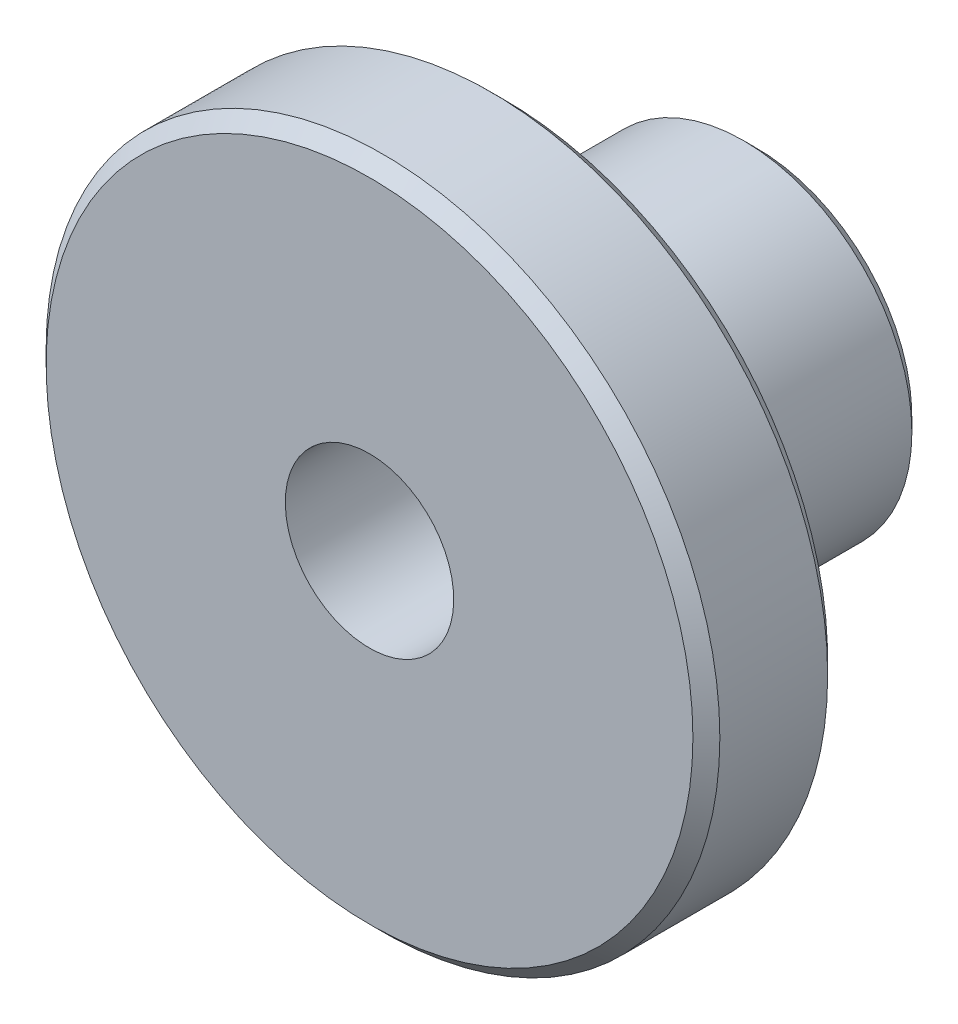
ISO-10303-21;
HEADER;
FILE_DESCRIPTION(('STEP AP214'),'2;1');
FILE_NAME('part.step','',(''),(''),'','','');
FILE_SCHEMA(('AUTOMOTIVE_DESIGN { 1 0 10303 214 1 1 1 1 }'));
ENDSEC;
DATA;
#1=APPLICATION_CONTEXT('core data for automotive mechanical design processes');
#2=APPLICATION_PROTOCOL_DEFINITION('international standard','automotive_design',2000,#1);
#3=PRODUCT_CONTEXT('',#1,'mechanical');
#4=PRODUCT('Part','Part','',(#3));
#5=PRODUCT_RELATED_PRODUCT_CATEGORY('part','',(#4));
#6=PRODUCT_DEFINITION_FORMATION('','',#4);
#7=PRODUCT_DEFINITION_CONTEXT('part definition',#1,'design');
#8=PRODUCT_DEFINITION('design','',#6,#7);
#9=PRODUCT_DEFINITION_SHAPE('','',#8);
#10=(LENGTH_UNIT() NAMED_UNIT(*) SI_UNIT(.MILLI.,.METRE.));
#11=(NAMED_UNIT(*) PLANE_ANGLE_UNIT() SI_UNIT($,.RADIAN.));
#12=(NAMED_UNIT(*) SI_UNIT($,.STERADIAN.) SOLID_ANGLE_UNIT());
#13=UNCERTAINTY_MEASURE_WITH_UNIT(LENGTH_MEASURE(1.E-05),#10,'distance_accuracy_value','');
#14=(GEOMETRIC_REPRESENTATION_CONTEXT(3) GLOBAL_UNCERTAINTY_ASSIGNED_CONTEXT((#13)) GLOBAL_UNIT_ASSIGNED_CONTEXT((#10,
#11,#12)) REPRESENTATION_CONTEXT('',''));
#15=CARTESIAN_POINT('',(0.,0.,0.));
#16=DIRECTION('',(0.,0.,1.));
#17=DIRECTION('',(1.,0.,0.));
#18=AXIS2_PLACEMENT_3D('',#15,#16,#17);
#19=CARTESIAN_POINT('',(0.,0.,0.));
#20=DIRECTION('',(0.,0.,-1.));
#21=DIRECTION('',(0.,1.,0.));
#22=AXIS2_PLACEMENT_3D('',#19,#20,#21);
#23=PLANE('',#22);
#24=CARTESIAN_POINT('',(0.,0.,0.));
#25=DIRECTION('',(0.,0.,-1.));
#26=DIRECTION('',(-1.,0.,0.));
#27=AXIS2_PLACEMENT_3D('',#24,#25,#26);
#28=CIRCLE('',#27,4.6);
#29=CARTESIAN_POINT('',(-4.6,0.,0.));
#30=VERTEX_POINT('',#29);
#31=EDGE_CURVE('E27',#30,#30,#28,.T.);
#32=ORIENTED_EDGE('',*,*,#31,.T.);
#33=EDGE_LOOP('',(#32));
#34=FACE_BOUND('',#33,.T.);
#35=CARTESIAN_POINT('',(0.,0.,0.));
#36=DIRECTION('',(0.,0.,-1.));
#37=DIRECTION('',(0.,1.,0.));
#38=AXIS2_PLACEMENT_3D('',#35,#36,#37);
#39=CIRCLE('',#38,2.5);
#40=CARTESIAN_POINT('',(0.,2.5,0.));
#41=VERTEX_POINT('',#40);
#42=EDGE_CURVE('E47',#41,#41,#39,.T.);
#43=ORIENTED_EDGE('',*,*,#42,.F.);
#44=EDGE_LOOP('',(#43));
#45=FACE_BOUND('',#44,.T.);
#46=ADVANCED_FACE('F12',(#34,#45),#23,.T.);
#47=CARTESIAN_POINT('',(0.,0.,-10.));
#48=DIRECTION('',(0.,0.,-1.));
#49=DIRECTION('',(0.,1.,0.));
#50=AXIS2_PLACEMENT_3D('',#47,#48,#49);
#51=CYLINDRICAL_SURFACE('',#50,5.);
#52=CARTESIAN_POINT('',(0.,0.,6.5));
#53=DIRECTION('',(0.,0.,-1.));
#54=DIRECTION('',(-1.,0.,0.));
#55=AXIS2_PLACEMENT_3D('',#52,#53,#54);
#56=CIRCLE('',#55,5.);
#57=CARTESIAN_POINT('',(-5.,0.,6.5));
#58=VERTEX_POINT('',#57);
#59=EDGE_CURVE('E19',#58,#58,#56,.T.);
#60=ORIENTED_EDGE('',*,*,#59,.T.);
#61=EDGE_LOOP('',(#60));
#62=FACE_BOUND('',#61,.T.);
#63=CARTESIAN_POINT('',(0.,0.,0.400000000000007));
#64=DIRECTION('',(0.,0.,-1.));
#65=DIRECTION('',(-1.,0.,0.));
#66=AXIS2_PLACEMENT_3D('',#63,#64,#65);
#67=CIRCLE('',#66,5.);
#68=CARTESIAN_POINT('',(-5.,0.,0.400000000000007));
#69=VERTEX_POINT('',#68);
#70=EDGE_CURVE('E23',#69,#69,#67,.F.);
#71=ORIENTED_EDGE('',*,*,#70,.T.);
#72=EDGE_LOOP('',(#71));
#73=FACE_BOUND('',#72,.T.);
#74=ADVANCED_FACE('F54',(#62,#73),#51,.T.);
#75=CARTESIAN_POINT('',(5.,0.,7.5));
#76=DIRECTION('',(0.,0.,-1.));
#77=DIRECTION('',(0.,1.,0.));
#78=AXIS2_PLACEMENT_3D('',#75,#76,#77);
#79=PLANE('',#78);
#80=CARTESIAN_POINT('',(0.,0.,7.5));
#81=DIRECTION('',(0.,0.,-1.));
#82=DIRECTION('',(-1.,0.,0.));
#83=AXIS2_PLACEMENT_3D('',#80,#81,#82);
#84=CIRCLE('',#83,6.);
#85=CARTESIAN_POINT('',(-6.,0.,7.5));
#86=VERTEX_POINT('',#85);
#87=EDGE_CURVE('E8',#86,#86,#84,.F.);
#88=ORIENTED_EDGE('',*,*,#87,.T.);
#89=EDGE_LOOP('',(#88));
#90=FACE_BOUND('',#89,.T.);
#91=CARTESIAN_POINT('',(0.,0.,7.5));
#92=DIRECTION('',(0.,0.,-1.));
#93=DIRECTION('',(-1.,0.,0.));
#94=AXIS2_PLACEMENT_3D('',#91,#92,#93);
#95=CIRCLE('',#94,9.6);
#96=CARTESIAN_POINT('',(-9.6,0.,7.5));
#97=VERTEX_POINT('',#96);
#98=EDGE_CURVE('E41',#97,#97,#95,.T.);
#99=ORIENTED_EDGE('',*,*,#98,.T.);
#100=EDGE_LOOP('',(#99));
#101=FACE_BOUND('',#100,.T.);
#102=ADVANCED_FACE('F62',(#90,#101),#79,.T.);
#103=CARTESIAN_POINT('',(0.,0.,-10.));
#104=DIRECTION('',(0.,0.,-1.));
#105=DIRECTION('',(0.,1.,0.));
#106=AXIS2_PLACEMENT_3D('',#103,#104,#105);
#107=CYLINDRICAL_SURFACE('',#106,10.);
#108=CARTESIAN_POINT('',(0.,0.,7.9));
#109=DIRECTION('',(0.,0.,-1.));
#110=DIRECTION('',(-1.,0.,0.));
#111=AXIS2_PLACEMENT_3D('',#108,#109,#110);
#112=CIRCLE('',#111,10.);
#113=CARTESIAN_POINT('',(-10.,0.,7.9));
#114=VERTEX_POINT('',#113);
#115=EDGE_CURVE('E35',#114,#114,#112,.F.);
#116=ORIENTED_EDGE('',*,*,#115,.T.);
#117=EDGE_LOOP('',(#116));
#118=FACE_BOUND('',#117,.T.);
#119=CARTESIAN_POINT('',(0.,0.,11.1));
#120=DIRECTION('',(0.,0.,1.));
#121=DIRECTION('',(1.,0.,0.));
#122=AXIS2_PLACEMENT_3D('',#119,#120,#121);
#123=CIRCLE('',#122,10.);
#124=CARTESIAN_POINT('',(10.,0.,11.1));
#125=VERTEX_POINT('',#124);
#126=EDGE_CURVE('E38',#125,#125,#123,.F.);
#127=ORIENTED_EDGE('',*,*,#126,.T.);
#128=EDGE_LOOP('',(#127));
#129=FACE_BOUND('',#128,.T.);
#130=ADVANCED_FACE('F117',(#118,#129),#107,.T.);
#131=CARTESIAN_POINT('',(10.,0.,11.5));
#132=DIRECTION('',(0.,0.,1.));
#133=DIRECTION('',(0.,-1.,0.));
#134=AXIS2_PLACEMENT_3D('',#131,#132,#133);
#135=PLANE('',#134);
#136=CARTESIAN_POINT('',(0.,0.,11.5));
#137=DIRECTION('',(0.,0.,1.));
#138=DIRECTION('',(1.,0.,0.));
#139=AXIS2_PLACEMENT_3D('',#136,#137,#138);
#140=CIRCLE('',#139,9.6);
#141=CARTESIAN_POINT('',(9.6,0.,11.5));
#142=VERTEX_POINT('',#141);
#143=EDGE_CURVE('E32',#142,#142,#140,.T.);
#144=ORIENTED_EDGE('',*,*,#143,.T.);
#145=EDGE_LOOP('',(#144));
#146=FACE_BOUND('',#145,.T.);
#147=CARTESIAN_POINT('',(0.,0.,11.5));
#148=DIRECTION('',(0.,0.,-1.));
#149=DIRECTION('',(0.,1.,0.));
#150=AXIS2_PLACEMENT_3D('',#147,#148,#149);
#151=CIRCLE('',#150,2.5);
#152=CARTESIAN_POINT('',(0.,2.5,11.5));
#153=VERTEX_POINT('',#152);
#154=EDGE_CURVE('E44',#153,#153,#151,.T.);
#155=ORIENTED_EDGE('',*,*,#154,.T.);
#156=EDGE_LOOP('',(#155));
#157=FACE_BOUND('',#156,.T.);
#158=ADVANCED_FACE('F106',(#146,#157),#135,.T.);
#159=CARTESIAN_POINT('',(0.,0.,11.5));
#160=DIRECTION('',(0.,0.,-1.));
#161=DIRECTION('',(0.,1.,0.));
#162=AXIS2_PLACEMENT_3D('',#159,#160,#161);
#163=CYLINDRICAL_SURFACE('',#162,2.5);
#164=ORIENTED_EDGE('',*,*,#154,.F.);
#165=EDGE_LOOP('',(#164));
#166=FACE_BOUND('',#165,.T.);
#167=ORIENTED_EDGE('',*,*,#42,.T.);
#168=EDGE_LOOP('',(#167));
#169=FACE_BOUND('',#168,.T.);
#170=ADVANCED_FACE('F51',(#166,#169),#163,.F.);
#171=CARTESIAN_POINT('',(0.,0.,7.5));
#172=DIRECTION('',(0.,0.,1.));
#173=DIRECTION('',(1.,0.,0.));
#174=AXIS2_PLACEMENT_3D('',#171,#172,#173);
#175=CONICAL_SURFACE('',#174,9.6,0.78539816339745);
#176=ORIENTED_EDGE('',*,*,#115,.F.);
#177=EDGE_LOOP('',(#176));
#178=FACE_BOUND('',#177,.T.);
#179=ORIENTED_EDGE('',*,*,#98,.F.);
#180=EDGE_LOOP('',(#179));
#181=FACE_BOUND('',#180,.T.);
#182=ADVANCED_FACE('F66',(#178,#181),#175,.T.);
#183=CARTESIAN_POINT('',(0.,0.,11.1));
#184=DIRECTION('',(0.,0.,-1.));
#185=DIRECTION('',(-1.,0.,0.));
#186=AXIS2_PLACEMENT_3D('',#183,#184,#185);
#187=CONICAL_SURFACE('',#186,10.,0.785398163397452);
#188=ORIENTED_EDGE('',*,*,#143,.F.);
#189=EDGE_LOOP('',(#188));
#190=FACE_BOUND('',#189,.T.);
#191=ORIENTED_EDGE('',*,*,#126,.F.);
#192=EDGE_LOOP('',(#191));
#193=FACE_BOUND('',#192,.T.);
#194=ADVANCED_FACE('F69',(#190,#193),#187,.T.);
#195=CARTESIAN_POINT('',(0.,0.,0.));
#196=DIRECTION('',(0.,0.,1.));
#197=DIRECTION('',(1.,0.,0.));
#198=AXIS2_PLACEMENT_3D('',#195,#196,#197);
#199=CONICAL_SURFACE('',#198,4.6,0.785398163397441);
#200=ORIENTED_EDGE('',*,*,#70,.F.);
#201=EDGE_LOOP('',(#200));
#202=FACE_BOUND('',#201,.T.);
#203=ORIENTED_EDGE('',*,*,#31,.F.);
#204=EDGE_LOOP('',(#203));
#205=FACE_BOUND('',#204,.T.);
#206=ADVANCED_FACE('F72',(#202,#205),#199,.T.);
#207=CARTESIAN_POINT('',(0.,0.,6.5));
#208=DIRECTION('',(0.,0.,-1.));
#209=DIRECTION('',(-1.,0.,0.));
#210=AXIS2_PLACEMENT_3D('',#207,#208,#209);
#211=TOROIDAL_SURFACE('',#210,6.,1.);
#212=ORIENTED_EDGE('',*,*,#87,.F.);
#213=EDGE_LOOP('',(#212));
#214=FACE_BOUND('',#213,.T.);
#215=ORIENTED_EDGE('',*,*,#59,.F.);
#216=EDGE_LOOP('',(#215));
#217=FACE_BOUND('',#216,.T.);
#218=ADVANCED_FACE('F14',(#214,#217),#211,.F.);
#219=CLOSED_SHELL('',(#46,#74,#102,#130,#158,#170,#182,#194,#206,#218));
#220=MANIFOLD_SOLID_BREP('B1',#219);
#221=ADVANCED_BREP_SHAPE_REPRESENTATION('',(#18,#220),#14);
#222=SHAPE_DEFINITION_REPRESENTATION(#9,#221);
ENDSEC;
END-ISO-10303-21;
